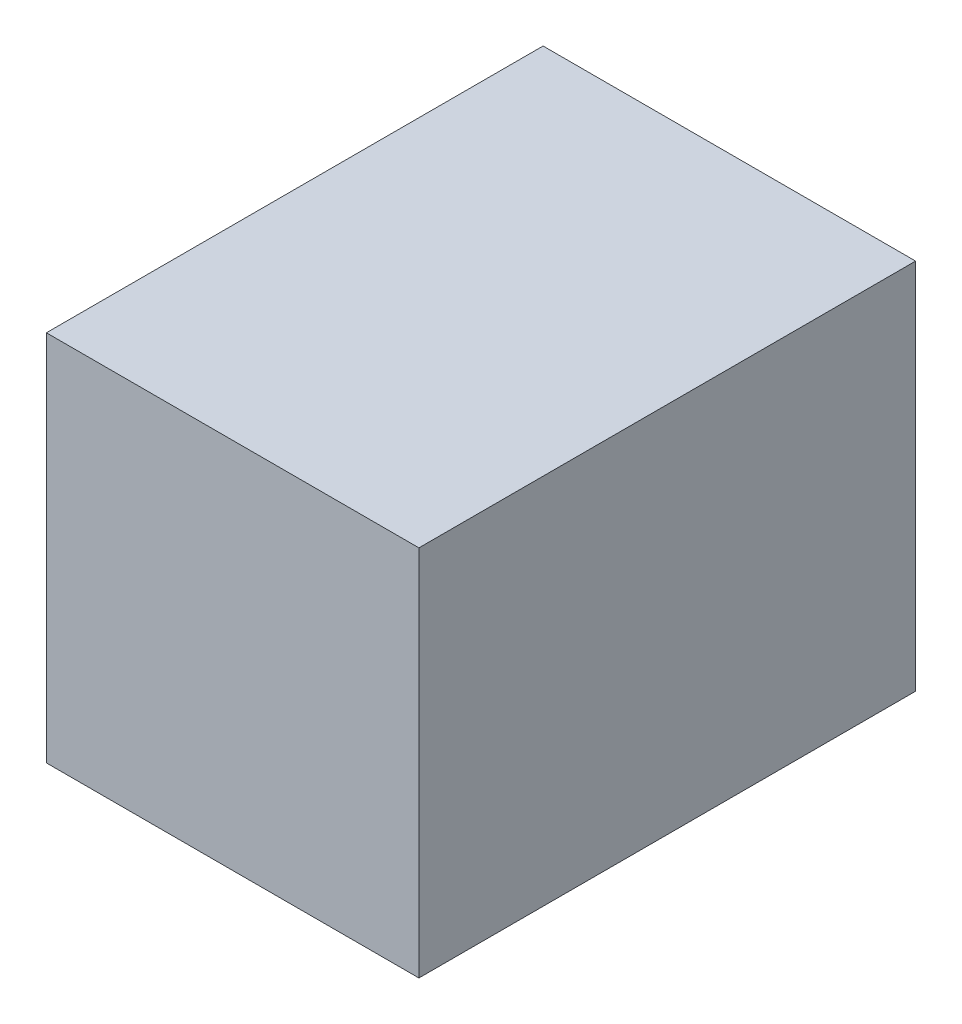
ISO-10303-21;
HEADER;
FILE_DESCRIPTION(('STEP AP214'),'2;1');
FILE_NAME('part.step','',(''),(''),'','','');
FILE_SCHEMA(('AUTOMOTIVE_DESIGN { 1 0 10303 214 1 1 1 1 }'));
ENDSEC;
DATA;
#1=APPLICATION_CONTEXT('core data for automotive mechanical design processes');
#2=APPLICATION_PROTOCOL_DEFINITION('international standard','automotive_design',2000,#1);
#3=PRODUCT_CONTEXT('',#1,'mechanical');
#4=PRODUCT('Part','Part','',(#3));
#5=PRODUCT_RELATED_PRODUCT_CATEGORY('part','',(#4));
#6=PRODUCT_DEFINITION_FORMATION('','',#4);
#7=PRODUCT_DEFINITION_CONTEXT('part definition',#1,'design');
#8=PRODUCT_DEFINITION('design','',#6,#7);
#9=PRODUCT_DEFINITION_SHAPE('','',#8);
#10=(LENGTH_UNIT() NAMED_UNIT(*) SI_UNIT(.MILLI.,.METRE.));
#11=(NAMED_UNIT(*) PLANE_ANGLE_UNIT() SI_UNIT($,.RADIAN.));
#12=(NAMED_UNIT(*) SI_UNIT($,.STERADIAN.) SOLID_ANGLE_UNIT());
#13=UNCERTAINTY_MEASURE_WITH_UNIT(LENGTH_MEASURE(1.E-05),#10,'distance_accuracy_value','');
#14=(GEOMETRIC_REPRESENTATION_CONTEXT(3) GLOBAL_UNCERTAINTY_ASSIGNED_CONTEXT((#13)) GLOBAL_UNIT_ASSIGNED_CONTEXT((#10,
#11,#12)) REPRESENTATION_CONTEXT('',''));
#15=CARTESIAN_POINT('',(0.,0.,0.));
#16=DIRECTION('',(0.,0.,1.));
#17=DIRECTION('',(1.,0.,0.));
#18=AXIS2_PLACEMENT_3D('',#15,#16,#17);
#19=CARTESIAN_POINT('',(150.,-150.,200.));
#20=DIRECTION('',(-1.,0.,0.));
#21=DIRECTION('',(0.,0.,1.));
#22=AXIS2_PLACEMENT_3D('',#19,#20,#21);
#23=PLANE('',#22);
#24=DIRECTION('',(0.,1.,0.));
#25=VECTOR('',#24,1.);
#26=CARTESIAN_POINT('',(150.,-150.,-200.));
#27=LINE('',#26,#25);
#28=CARTESIAN_POINT('',(150.,-150.,-200.));
#29=VERTEX_POINT('',#28);
#30=CARTESIAN_POINT('',(150.,150.,-200.));
#31=VERTEX_POINT('',#30);
#32=EDGE_CURVE('E147',#29,#31,#27,.T.);
#33=ORIENTED_EDGE('',*,*,#32,.T.);
#34=DIRECTION('',(0.,0.,-1.));
#35=VECTOR('',#34,1.);
#36=CARTESIAN_POINT('',(150.,150.,200.));
#37=LINE('',#36,#35);
#38=CARTESIAN_POINT('',(150.,150.,200.));
#39=VERTEX_POINT('',#38);
#40=EDGE_CURVE('E138',#39,#31,#37,.T.);
#41=ORIENTED_EDGE('',*,*,#40,.F.);
#42=DIRECTION('',(0.,1.,0.));
#43=VECTOR('',#42,1.);
#44=CARTESIAN_POINT('',(150.,-150.,200.));
#45=LINE('',#44,#43);
#46=CARTESIAN_POINT('',(150.,-150.,200.));
#47=VERTEX_POINT('',#46);
#48=EDGE_CURVE('E132',#47,#39,#45,.T.);
#49=ORIENTED_EDGE('',*,*,#48,.F.);
#50=DIRECTION('',(0.,0.,-1.));
#51=VECTOR('',#50,1.);
#52=CARTESIAN_POINT('',(150.,-150.,200.));
#53=LINE('',#52,#51);
#54=EDGE_CURVE('E143',#47,#29,#53,.T.);
#55=ORIENTED_EDGE('',*,*,#54,.T.);
#56=EDGE_LOOP('',(#33,#41,#49,#55));
#57=FACE_BOUND('',#56,.T.);
#58=ADVANCED_FACE('F41',(#57),#23,.F.);
#59=CARTESIAN_POINT('',(-150.,150.,200.));
#60=DIRECTION('',(0.,-1.,0.));
#61=DIRECTION('',(0.,0.,-1.));
#62=AXIS2_PLACEMENT_3D('',#59,#60,#61);
#63=PLANE('',#62);
#64=DIRECTION('',(-1.,0.,0.));
#65=VECTOR('',#64,1.);
#66=CARTESIAN_POINT('',(-150.,150.,-200.));
#67=LINE('',#66,#65);
#68=CARTESIAN_POINT('',(-150.,150.,-200.));
#69=VERTEX_POINT('',#68);
#70=EDGE_CURVE('E137',#31,#69,#67,.T.);
#71=ORIENTED_EDGE('',*,*,#70,.T.);
#72=DIRECTION('',(0.,0.,-1.));
#73=VECTOR('',#72,1.);
#74=CARTESIAN_POINT('',(-150.,150.,200.));
#75=LINE('',#74,#73);
#76=CARTESIAN_POINT('',(-150.,150.,200.));
#77=VERTEX_POINT('',#76);
#78=EDGE_CURVE('E135',#77,#69,#75,.T.);
#79=ORIENTED_EDGE('',*,*,#78,.F.);
#80=DIRECTION('',(-1.,0.,0.));
#81=VECTOR('',#80,1.);
#82=CARTESIAN_POINT('',(-150.,150.,200.));
#83=LINE('',#82,#81);
#84=EDGE_CURVE('E127',#39,#77,#83,.T.);
#85=ORIENTED_EDGE('',*,*,#84,.F.);
#86=ORIENTED_EDGE('',*,*,#40,.T.);
#87=EDGE_LOOP('',(#71,#79,#85,#86));
#88=FACE_BOUND('',#87,.T.);
#89=ADVANCED_FACE('F136',(#88),#63,.F.);
#90=CARTESIAN_POINT('',(-150.,-150.,200.));
#91=DIRECTION('',(1.,0.,0.));
#92=DIRECTION('',(0.,0.,-1.));
#93=AXIS2_PLACEMENT_3D('',#90,#91,#92);
#94=PLANE('',#93);
#95=DIRECTION('',(0.,-1.,0.));
#96=VECTOR('',#95,1.);
#97=CARTESIAN_POINT('',(-150.,-150.,-200.));
#98=LINE('',#97,#96);
#99=CARTESIAN_POINT('',(-150.,-150.,-200.));
#100=VERTEX_POINT('',#99);
#101=EDGE_CURVE('E113',#69,#100,#98,.T.);
#102=ORIENTED_EDGE('',*,*,#101,.T.);
#103=DIRECTION('',(0.,0.,-1.));
#104=VECTOR('',#103,1.);
#105=CARTESIAN_POINT('',(-150.,-150.,200.));
#106=LINE('',#105,#104);
#107=CARTESIAN_POINT('',(-150.,-150.,200.));
#108=VERTEX_POINT('',#107);
#109=EDGE_CURVE('E139',#108,#100,#106,.T.);
#110=ORIENTED_EDGE('',*,*,#109,.F.);
#111=DIRECTION('',(0.,-1.,0.));
#112=VECTOR('',#111,1.);
#113=CARTESIAN_POINT('',(-150.,-150.,200.));
#114=LINE('',#113,#112);
#115=EDGE_CURVE('E130',#77,#108,#114,.T.);
#116=ORIENTED_EDGE('',*,*,#115,.F.);
#117=ORIENTED_EDGE('',*,*,#78,.T.);
#118=EDGE_LOOP('',(#102,#110,#116,#117));
#119=FACE_BOUND('',#118,.T.);
#120=ADVANCED_FACE('F141',(#119),#94,.F.);
#121=CARTESIAN_POINT('',(-150.,-150.,200.));
#122=DIRECTION('',(0.,1.,0.));
#123=DIRECTION('',(0.,0.,1.));
#124=AXIS2_PLACEMENT_3D('',#121,#122,#123);
#125=PLANE('',#124);
#126=DIRECTION('',(1.,0.,0.));
#127=VECTOR('',#126,1.);
#128=CARTESIAN_POINT('',(-150.,-150.,-200.));
#129=LINE('',#128,#127);
#130=EDGE_CURVE('E119',#100,#29,#129,.T.);
#131=ORIENTED_EDGE('',*,*,#130,.T.);
#132=ORIENTED_EDGE('',*,*,#54,.F.);
#133=DIRECTION('',(1.,0.,0.));
#134=VECTOR('',#133,1.);
#135=CARTESIAN_POINT('',(-150.,-150.,200.));
#136=LINE('',#135,#134);
#137=EDGE_CURVE('E96',#108,#47,#136,.T.);
#138=ORIENTED_EDGE('',*,*,#137,.F.);
#139=ORIENTED_EDGE('',*,*,#109,.T.);
#140=EDGE_LOOP('',(#131,#132,#138,#139));
#141=FACE_BOUND('',#140,.T.);
#142=ADVANCED_FACE('F212',(#141),#125,.F.);
#143=CARTESIAN_POINT('',(150.,150.,200.));
#144=DIRECTION('',(0.,0.,-1.));
#145=DIRECTION('',(-1.,0.,0.));
#146=AXIS2_PLACEMENT_3D('',#143,#144,#145);
#147=PLANE('',#146);
#148=ORIENTED_EDGE('',*,*,#48,.T.);
#149=ORIENTED_EDGE('',*,*,#84,.T.);
#150=ORIENTED_EDGE('',*,*,#115,.T.);
#151=ORIENTED_EDGE('',*,*,#137,.T.);
#152=EDGE_LOOP('',(#148,#149,#150,#151));
#153=FACE_BOUND('',#152,.T.);
#154=ADVANCED_FACE('F128',(#153),#147,.F.);
#155=CARTESIAN_POINT('',(150.,150.,-200.));
#156=DIRECTION('',(0.,0.,-1.));
#157=DIRECTION('',(-1.,0.,0.));
#158=AXIS2_PLACEMENT_3D('',#155,#156,#157);
#159=PLANE('',#158);
#160=ORIENTED_EDGE('',*,*,#32,.F.);
#161=ORIENTED_EDGE('',*,*,#130,.F.);
#162=ORIENTED_EDGE('',*,*,#101,.F.);
#163=ORIENTED_EDGE('',*,*,#70,.F.);
#164=EDGE_LOOP('',(#160,#161,#162,#163));
#165=FACE_BOUND('',#164,.T.);
#166=ADVANCED_FACE('F215',(#165),#159,.T.);
#167=CLOSED_SHELL('',(#58,#89,#120,#142,#154,#166));
#168=CARTESIAN_POINT('',(145.,-150.,200.));
#169=DIRECTION('',(-1.,0.,0.));
#170=DIRECTION('',(0.,0.,1.));
#171=AXIS2_PLACEMENT_3D('',#168,#169,#170);
#172=PLANE('',#171);
#173=DIRECTION('',(0.,1.,0.));
#174=VECTOR('',#173,1.);
#175=CARTESIAN_POINT('',(145.,150.,-195.));
#176=LINE('',#175,#174);
#177=CARTESIAN_POINT('',(145.,-145.,-195.));
#178=VERTEX_POINT('',#177);
#179=CARTESIAN_POINT('',(145.,145.,-195.));
#180=VERTEX_POINT('',#179);
#181=EDGE_CURVE('E45',#178,#180,#176,.T.);
#182=ORIENTED_EDGE('',*,*,#181,.F.);
#183=DIRECTION('',(0.,0.,-1.));
#184=VECTOR('',#183,1.);
#185=CARTESIAN_POINT('',(145.,-145.,200.));
#186=LINE('',#185,#184);
#187=CARTESIAN_POINT('',(145.,-145.,195.));
#188=VERTEX_POINT('',#187);
#189=EDGE_CURVE('E172',#188,#178,#186,.T.);
#190=ORIENTED_EDGE('',*,*,#189,.F.);
#191=DIRECTION('',(0.,1.,0.));
#192=VECTOR('',#191,1.);
#193=CARTESIAN_POINT('',(145.,150.,195.));
#194=LINE('',#193,#192);
#195=CARTESIAN_POINT('',(145.,145.,195.));
#196=VERTEX_POINT('',#195);
#197=EDGE_CURVE('E159',#188,#196,#194,.T.);
#198=ORIENTED_EDGE('',*,*,#197,.T.);
#199=DIRECTION('',(0.,0.,-1.));
#200=VECTOR('',#199,1.);
#201=CARTESIAN_POINT('',(145.,145.,200.));
#202=LINE('',#201,#200);
#203=EDGE_CURVE('E170',#196,#180,#202,.T.);
#204=ORIENTED_EDGE('',*,*,#203,.T.);
#205=EDGE_LOOP('',(#182,#190,#198,#204));
#206=FACE_BOUND('',#205,.T.);
#207=ADVANCED_FACE('F179',(#206),#172,.T.);
#208=CARTESIAN_POINT('',(-150.,145.,200.));
#209=DIRECTION('',(0.,-1.,0.));
#210=DIRECTION('',(0.,0.,-1.));
#211=AXIS2_PLACEMENT_3D('',#208,#209,#210);
#212=PLANE('',#211);
#213=DIRECTION('',(-1.,0.,0.));
#214=VECTOR('',#213,1.);
#215=CARTESIAN_POINT('',(150.,145.,-195.));
#216=LINE('',#215,#214);
#217=CARTESIAN_POINT('',(-145.,145.,-195.));
#218=VERTEX_POINT('',#217);
#219=EDGE_CURVE('E61',#180,#218,#216,.T.);
#220=ORIENTED_EDGE('',*,*,#219,.F.);
#221=ORIENTED_EDGE('',*,*,#203,.F.);
#222=DIRECTION('',(-1.,0.,0.));
#223=VECTOR('',#222,1.);
#224=CARTESIAN_POINT('',(150.,145.,195.));
#225=LINE('',#224,#223);
#226=CARTESIAN_POINT('',(-145.,145.,195.));
#227=VERTEX_POINT('',#226);
#228=EDGE_CURVE('E84',#196,#227,#225,.T.);
#229=ORIENTED_EDGE('',*,*,#228,.T.);
#230=DIRECTION('',(0.,0.,-1.));
#231=VECTOR('',#230,1.);
#232=CARTESIAN_POINT('',(-145.,145.,200.));
#233=LINE('',#232,#231);
#234=EDGE_CURVE('E166',#227,#218,#233,.T.);
#235=ORIENTED_EDGE('',*,*,#234,.T.);
#236=EDGE_LOOP('',(#220,#221,#229,#235));
#237=FACE_BOUND('',#236,.T.);
#238=ADVANCED_FACE('F180',(#237),#212,.T.);
#239=CARTESIAN_POINT('',(-145.,-150.,200.));
#240=DIRECTION('',(1.,0.,0.));
#241=DIRECTION('',(0.,0.,-1.));
#242=AXIS2_PLACEMENT_3D('',#239,#240,#241);
#243=PLANE('',#242);
#244=DIRECTION('',(0.,-1.,0.));
#245=VECTOR('',#244,1.);
#246=CARTESIAN_POINT('',(-145.,150.,-195.));
#247=LINE('',#246,#245);
#248=CARTESIAN_POINT('',(-145.,-145.,-195.));
#249=VERTEX_POINT('',#248);
#250=EDGE_CURVE('E168',#218,#249,#247,.T.);
#251=ORIENTED_EDGE('',*,*,#250,.F.);
#252=ORIENTED_EDGE('',*,*,#234,.F.);
#253=DIRECTION('',(0.,-1.,0.));
#254=VECTOR('',#253,1.);
#255=CARTESIAN_POINT('',(-145.,150.,195.));
#256=LINE('',#255,#254);
#257=CARTESIAN_POINT('',(-145.,-145.,195.));
#258=VERTEX_POINT('',#257);
#259=EDGE_CURVE('E52',#227,#258,#256,.T.);
#260=ORIENTED_EDGE('',*,*,#259,.T.);
#261=DIRECTION('',(0.,0.,-1.));
#262=VECTOR('',#261,1.);
#263=CARTESIAN_POINT('',(-145.,-145.,200.));
#264=LINE('',#263,#262);
#265=EDGE_CURVE('E161',#258,#249,#264,.T.);
#266=ORIENTED_EDGE('',*,*,#265,.T.);
#267=EDGE_LOOP('',(#251,#252,#260,#266));
#268=FACE_BOUND('',#267,.T.);
#269=ADVANCED_FACE('F184',(#268),#243,.T.);
#270=CARTESIAN_POINT('',(-150.,-145.,200.));
#271=DIRECTION('',(0.,1.,0.));
#272=DIRECTION('',(0.,0.,1.));
#273=AXIS2_PLACEMENT_3D('',#270,#271,#272);
#274=PLANE('',#273);
#275=DIRECTION('',(1.,0.,0.));
#276=VECTOR('',#275,1.);
#277=CARTESIAN_POINT('',(150.,-145.,-195.));
#278=LINE('',#277,#276);
#279=EDGE_CURVE('E164',#249,#178,#278,.T.);
#280=ORIENTED_EDGE('',*,*,#279,.F.);
#281=ORIENTED_EDGE('',*,*,#265,.F.);
#282=DIRECTION('',(1.,0.,0.));
#283=VECTOR('',#282,1.);
#284=CARTESIAN_POINT('',(150.,-145.,195.));
#285=LINE('',#284,#283);
#286=EDGE_CURVE('E11',#258,#188,#285,.T.);
#287=ORIENTED_EDGE('',*,*,#286,.T.);
#288=ORIENTED_EDGE('',*,*,#189,.T.);
#289=EDGE_LOOP('',(#280,#281,#287,#288));
#290=FACE_BOUND('',#289,.T.);
#291=ADVANCED_FACE('F188',(#290),#274,.T.);
#292=CARTESIAN_POINT('',(150.,150.,195.));
#293=DIRECTION('',(0.,0.,-1.));
#294=DIRECTION('',(-1.,0.,0.));
#295=AXIS2_PLACEMENT_3D('',#292,#293,#294);
#296=PLANE('',#295);
#297=ORIENTED_EDGE('',*,*,#197,.F.);
#298=ORIENTED_EDGE('',*,*,#286,.F.);
#299=ORIENTED_EDGE('',*,*,#259,.F.);
#300=ORIENTED_EDGE('',*,*,#228,.F.);
#301=EDGE_LOOP('',(#297,#298,#299,#300));
#302=FACE_BOUND('',#301,.T.);
#303=ADVANCED_FACE('F187',(#302),#296,.T.);
#304=CARTESIAN_POINT('',(150.,150.,-195.));
#305=DIRECTION('',(0.,0.,-1.));
#306=DIRECTION('',(-1.,0.,0.));
#307=AXIS2_PLACEMENT_3D('',#304,#305,#306);
#308=PLANE('',#307);
#309=ORIENTED_EDGE('',*,*,#181,.T.);
#310=ORIENTED_EDGE('',*,*,#219,.T.);
#311=ORIENTED_EDGE('',*,*,#250,.T.);
#312=ORIENTED_EDGE('',*,*,#279,.T.);
#313=EDGE_LOOP('',(#309,#310,#311,#312));
#314=FACE_BOUND('',#313,.T.);
#315=ADVANCED_FACE('F43',(#314),#308,.F.);
#316=CLOSED_SHELL('',(#207,#238,#269,#291,#303,#315));
#317=ORIENTED_CLOSED_SHELL('',*,#316,.T.);
#318=BREP_WITH_VOIDS('B2',#167,(#317));
#319=ADVANCED_BREP_SHAPE_REPRESENTATION('',(#18,#318),#14);
#320=SHAPE_DEFINITION_REPRESENTATION(#9,#319);
ENDSEC;
END-ISO-10303-21;
